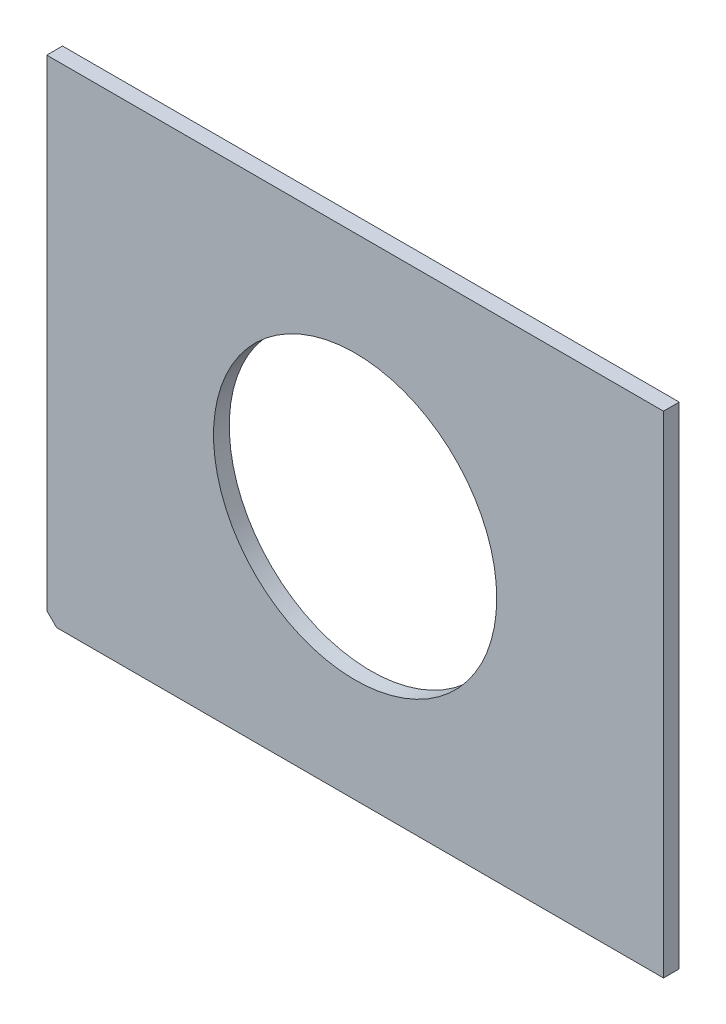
ISO-10303-21;
HEADER;
FILE_DESCRIPTION(('STEP AP214'),'2;1');
FILE_NAME('part.step','',(''),(''),'','','');
FILE_SCHEMA(('AUTOMOTIVE_DESIGN { 1 0 10303 214 1 1 1 1 }'));
ENDSEC;
DATA;
#1=APPLICATION_CONTEXT('core data for automotive mechanical design processes');
#2=APPLICATION_PROTOCOL_DEFINITION('international standard','automotive_design',2000,#1);
#3=PRODUCT_CONTEXT('',#1,'mechanical');
#4=PRODUCT('Part','Part','',(#3));
#5=PRODUCT_RELATED_PRODUCT_CATEGORY('part','',(#4));
#6=PRODUCT_DEFINITION_FORMATION('','',#4);
#7=PRODUCT_DEFINITION_CONTEXT('part definition',#1,'design');
#8=PRODUCT_DEFINITION('design','',#6,#7);
#9=PRODUCT_DEFINITION_SHAPE('','',#8);
#10=(LENGTH_UNIT() NAMED_UNIT(*) SI_UNIT(.MILLI.,.METRE.));
#11=(NAMED_UNIT(*) PLANE_ANGLE_UNIT() SI_UNIT($,.RADIAN.));
#12=(NAMED_UNIT(*) SI_UNIT($,.STERADIAN.) SOLID_ANGLE_UNIT());
#13=UNCERTAINTY_MEASURE_WITH_UNIT(LENGTH_MEASURE(1.E-05),#10,'distance_accuracy_value','');
#14=(GEOMETRIC_REPRESENTATION_CONTEXT(3) GLOBAL_UNCERTAINTY_ASSIGNED_CONTEXT((#13)) GLOBAL_UNIT_ASSIGNED_CONTEXT((#10,
#11,#12)) REPRESENTATION_CONTEXT('',''));
#15=CARTESIAN_POINT('',(0.,0.,0.));
#16=DIRECTION('',(0.,0.,1.));
#17=DIRECTION('',(1.,0.,0.));
#18=AXIS2_PLACEMENT_3D('',#15,#16,#17);
#19=CARTESIAN_POINT('',(-98.,-78.,-255.503492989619));
#20=DIRECTION('',(0.,-1.,0.));
#21=DIRECTION('',(0.,0.,-1.));
#22=AXIS2_PLACEMENT_3D('',#19,#20,#21);
#23=PLANE('',#22);
#24=DIRECTION('',(1.,0.,0.));
#25=VECTOR('',#24,1.);
#26=CARTESIAN_POINT('',(-98.,-78.,0.));
#27=LINE('',#26,#25);
#28=CARTESIAN_POINT('',(-94.8799999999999,-78.,0.));
#29=VERTEX_POINT('',#28);
#30=CARTESIAN_POINT('',(98.,-78.,0.));
#31=VERTEX_POINT('',#30);
#32=EDGE_CURVE('E78',#29,#31,#27,.T.);
#33=ORIENTED_EDGE('',*,*,#32,.F.);
#34=DIRECTION('',(0.,0.,-1.));
#35=VECTOR('',#34,1.);
#36=CARTESIAN_POINT('',(-94.8799999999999,-78.,-255.503492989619));
#37=LINE('',#36,#35);
#38=CARTESIAN_POINT('',(-94.8799999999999,-78.,-5.));
#39=VERTEX_POINT('',#38);
#40=EDGE_CURVE('E42',#29,#39,#37,.T.);
#41=ORIENTED_EDGE('',*,*,#40,.T.);
#42=DIRECTION('',(-1.,0.,0.));
#43=VECTOR('',#42,1.);
#44=CARTESIAN_POINT('',(-98.,-78.,-5.));
#45=LINE('',#44,#43);
#46=CARTESIAN_POINT('',(98.,-78.,-5.));
#47=VERTEX_POINT('',#46);
#48=EDGE_CURVE('E89',#47,#39,#45,.T.);
#49=ORIENTED_EDGE('',*,*,#48,.F.);
#50=DIRECTION('',(0.,0.,1.));
#51=VECTOR('',#50,1.);
#52=CARTESIAN_POINT('',(98.,-78.,-255.503492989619));
#53=LINE('',#52,#51);
#54=EDGE_CURVE('E88',#47,#31,#53,.T.);
#55=ORIENTED_EDGE('',*,*,#54,.T.);
#56=EDGE_LOOP('',(#33,#41,#49,#55));
#57=FACE_BOUND('',#56,.T.);
#58=ADVANCED_FACE('F34',(#57),#23,.T.);
#59=CARTESIAN_POINT('',(98.,-78.,-255.503492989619));
#60=DIRECTION('',(1.,0.,0.));
#61=DIRECTION('',(0.,1.,0.));
#62=AXIS2_PLACEMENT_3D('',#59,#60,#61);
#63=PLANE('',#62);
#64=DIRECTION('',(0.,-1.,0.));
#65=VECTOR('',#64,1.);
#66=CARTESIAN_POINT('',(98.,-78.,-5.));
#67=LINE('',#66,#65);
#68=CARTESIAN_POINT('',(98.,78.,-5.));
#69=VERTEX_POINT('',#68);
#70=EDGE_CURVE('E103',#69,#47,#67,.T.);
#71=ORIENTED_EDGE('',*,*,#70,.F.);
#72=DIRECTION('',(0.,0.,1.));
#73=VECTOR('',#72,1.);
#74=CARTESIAN_POINT('',(98.,78.,-255.503492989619));
#75=LINE('',#74,#73);
#76=CARTESIAN_POINT('',(98.,78.,0.));
#77=VERTEX_POINT('',#76);
#78=EDGE_CURVE('E92',#69,#77,#75,.T.);
#79=ORIENTED_EDGE('',*,*,#78,.T.);
#80=DIRECTION('',(0.,1.,0.));
#81=VECTOR('',#80,1.);
#82=CARTESIAN_POINT('',(98.,-78.,0.));
#83=LINE('',#82,#81);
#84=EDGE_CURVE('E83',#31,#77,#83,.T.);
#85=ORIENTED_EDGE('',*,*,#84,.F.);
#86=ORIENTED_EDGE('',*,*,#54,.F.);
#87=EDGE_LOOP('',(#71,#79,#85,#86));
#88=FACE_BOUND('',#87,.T.);
#89=ADVANCED_FACE('F95',(#88),#63,.T.);
#90=CARTESIAN_POINT('',(98.,78.,-255.503492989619));
#91=DIRECTION('',(0.,1.,0.));
#92=DIRECTION('',(-1.,0.,0.));
#93=AXIS2_PLACEMENT_3D('',#90,#91,#92);
#94=PLANE('',#93);
#95=DIRECTION('',(1.,0.,0.));
#96=VECTOR('',#95,1.);
#97=CARTESIAN_POINT('',(98.,78.,-5.));
#98=LINE('',#97,#96);
#99=CARTESIAN_POINT('',(-98.,78.,-5.));
#100=VERTEX_POINT('',#99);
#101=EDGE_CURVE('E125',#100,#69,#98,.T.);
#102=ORIENTED_EDGE('',*,*,#101,.F.);
#103=DIRECTION('',(0.,0.,1.));
#104=VECTOR('',#103,1.);
#105=CARTESIAN_POINT('',(-98.,78.,-255.503492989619));
#106=LINE('',#105,#104);
#107=CARTESIAN_POINT('',(-98.,78.,0.));
#108=VERTEX_POINT('',#107);
#109=EDGE_CURVE('E101',#100,#108,#106,.T.);
#110=ORIENTED_EDGE('',*,*,#109,.T.);
#111=DIRECTION('',(-1.,0.,0.));
#112=VECTOR('',#111,1.);
#113=CARTESIAN_POINT('',(98.,78.,0.));
#114=LINE('',#113,#112);
#115=EDGE_CURVE('E93',#77,#108,#114,.T.);
#116=ORIENTED_EDGE('',*,*,#115,.F.);
#117=ORIENTED_EDGE('',*,*,#78,.F.);
#118=EDGE_LOOP('',(#102,#110,#116,#117));
#119=FACE_BOUND('',#118,.T.);
#120=ADVANCED_FACE('F142',(#119),#94,.T.);
#121=CARTESIAN_POINT('',(-98.,78.,-255.503492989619));
#122=DIRECTION('',(-1.,0.,0.));
#123=DIRECTION('',(0.,-1.,0.));
#124=AXIS2_PLACEMENT_3D('',#121,#122,#123);
#125=PLANE('',#124);
#126=DIRECTION('',(0.,1.,0.));
#127=VECTOR('',#126,1.);
#128=CARTESIAN_POINT('',(-98.,78.,-5.));
#129=LINE('',#128,#127);
#130=CARTESIAN_POINT('',(-98.,-74.8799999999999,-5.));
#131=VERTEX_POINT('',#130);
#132=EDGE_CURVE('E117',#131,#100,#129,.T.);
#133=ORIENTED_EDGE('',*,*,#132,.F.);
#134=DIRECTION('',(0.,0.,1.));
#135=VECTOR('',#134,1.);
#136=CARTESIAN_POINT('',(-98.,-74.8799999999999,-255.503492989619));
#137=LINE('',#136,#135);
#138=CARTESIAN_POINT('',(-98.,-74.8799999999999,0.));
#139=VERTEX_POINT('',#138);
#140=EDGE_CURVE('E108',#131,#139,#137,.T.);
#141=ORIENTED_EDGE('',*,*,#140,.T.);
#142=DIRECTION('',(0.,-1.,0.));
#143=VECTOR('',#142,1.);
#144=CARTESIAN_POINT('',(-98.,78.,0.));
#145=LINE('',#144,#143);
#146=EDGE_CURVE('E85',#108,#139,#145,.T.);
#147=ORIENTED_EDGE('',*,*,#146,.F.);
#148=ORIENTED_EDGE('',*,*,#109,.F.);
#149=EDGE_LOOP('',(#133,#141,#147,#148));
#150=FACE_BOUND('',#149,.T.);
#151=ADVANCED_FACE('F115',(#150),#125,.T.);
#152=CARTESIAN_POINT('',(0.,0.,0.));
#153=DIRECTION('',(0.,0.,1.));
#154=DIRECTION('',(1.,0.,0.));
#155=AXIS2_PLACEMENT_3D('',#152,#153,#154);
#156=PLANE('',#155);
#157=CARTESIAN_POINT('',(0.,0.,0.));
#158=DIRECTION('',(0.,0.,1.));
#159=DIRECTION('',(1.,0.,0.));
#160=AXIS2_PLACEMENT_3D('',#157,#158,#159);
#161=CIRCLE('',#160,45.);
#162=CARTESIAN_POINT('',(45.,0.,0.));
#163=VERTEX_POINT('',#162);
#164=EDGE_CURVE('E120',#163,#163,#161,.T.);
#165=ORIENTED_EDGE('',*,*,#164,.F.);
#166=EDGE_LOOP('',(#165));
#167=FACE_BOUND('',#166,.T.);
#168=ORIENTED_EDGE('',*,*,#146,.T.);
#169=DIRECTION('',(-0.707106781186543,0.707106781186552,0.));
#170=VECTOR('',#169,1.);
#171=CARTESIAN_POINT('',(-86.4400000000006,-86.4399999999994,0.));
#172=LINE('',#171,#170);
#173=EDGE_CURVE('E56',#139,#29,#172,.F.);
#174=ORIENTED_EDGE('',*,*,#173,.T.);
#175=ORIENTED_EDGE('',*,*,#32,.T.);
#176=ORIENTED_EDGE('',*,*,#84,.T.);
#177=ORIENTED_EDGE('',*,*,#115,.T.);
#178=EDGE_LOOP('',(#168,#174,#175,#176,#177));
#179=FACE_BOUND('',#178,.T.);
#180=ADVANCED_FACE('F80',(#167,#179),#156,.T.);
#181=CARTESIAN_POINT('',(0.,0.,-255.503492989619));
#182=DIRECTION('',(0.,0.,1.));
#183=DIRECTION('',(1.,0.,0.));
#184=AXIS2_PLACEMENT_3D('',#181,#182,#183);
#185=CYLINDRICAL_SURFACE('',#184,45.);
#186=CARTESIAN_POINT('',(0.,0.,-5.));
#187=DIRECTION('',(0.,0.,1.));
#188=DIRECTION('',(1.,0.,0.));
#189=AXIS2_PLACEMENT_3D('',#186,#187,#188);
#190=CIRCLE('',#189,45.);
#191=CARTESIAN_POINT('',(45.,0.,-5.));
#192=VERTEX_POINT('',#191);
#193=EDGE_CURVE('E105',#192,#192,#190,.F.);
#194=ORIENTED_EDGE('',*,*,#193,.T.);
#195=EDGE_LOOP('',(#194));
#196=FACE_BOUND('',#195,.T.);
#197=ORIENTED_EDGE('',*,*,#164,.T.);
#198=EDGE_LOOP('',(#197));
#199=FACE_BOUND('',#198,.T.);
#200=ADVANCED_FACE('F135',(#196,#199),#185,.F.);
#201=CARTESIAN_POINT('',(0.,0.,-5.));
#202=DIRECTION('',(0.,0.,1.));
#203=DIRECTION('',(1.,0.,0.));
#204=AXIS2_PLACEMENT_3D('',#201,#202,#203);
#205=PLANE('',#204);
#206=ORIENTED_EDGE('',*,*,#48,.T.);
#207=DIRECTION('',(0.707106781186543,-0.707106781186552,0.));
#208=VECTOR('',#207,1.);
#209=CARTESIAN_POINT('',(-98.,-74.8799999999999,-5.));
#210=LINE('',#209,#208);
#211=EDGE_CURVE('E11',#39,#131,#210,.F.);
#212=ORIENTED_EDGE('',*,*,#211,.T.);
#213=ORIENTED_EDGE('',*,*,#132,.T.);
#214=ORIENTED_EDGE('',*,*,#101,.T.);
#215=ORIENTED_EDGE('',*,*,#70,.T.);
#216=EDGE_LOOP('',(#206,#212,#213,#214,#215));
#217=FACE_BOUND('',#216,.T.);
#218=ORIENTED_EDGE('',*,*,#193,.F.);
#219=EDGE_LOOP('',(#218));
#220=FACE_BOUND('',#219,.T.);
#221=ADVANCED_FACE('F129',(#217,#220),#205,.F.);
#222=CARTESIAN_POINT('',(-98.,-74.8799999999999,-255.503492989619));
#223=DIRECTION('',(0.707106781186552,0.707106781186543,0.));
#224=DIRECTION('',(0.,0.,1.));
#225=AXIS2_PLACEMENT_3D('',#222,#223,#224);
#226=PLANE('',#225);
#227=ORIENTED_EDGE('',*,*,#211,.F.);
#228=ORIENTED_EDGE('',*,*,#40,.F.);
#229=ORIENTED_EDGE('',*,*,#173,.F.);
#230=ORIENTED_EDGE('',*,*,#140,.F.);
#231=EDGE_LOOP('',(#227,#228,#229,#230));
#232=FACE_BOUND('',#231,.T.);
#233=ADVANCED_FACE('F36',(#232),#226,.F.);
#234=CLOSED_SHELL('',(#58,#89,#120,#151,#180,#200,#221,#233));
#235=MANIFOLD_SOLID_BREP('B2',#234);
#236=ADVANCED_BREP_SHAPE_REPRESENTATION('',(#18,#235),#14);
#237=SHAPE_DEFINITION_REPRESENTATION(#9,#236);
ENDSEC;
END-ISO-10303-21;
